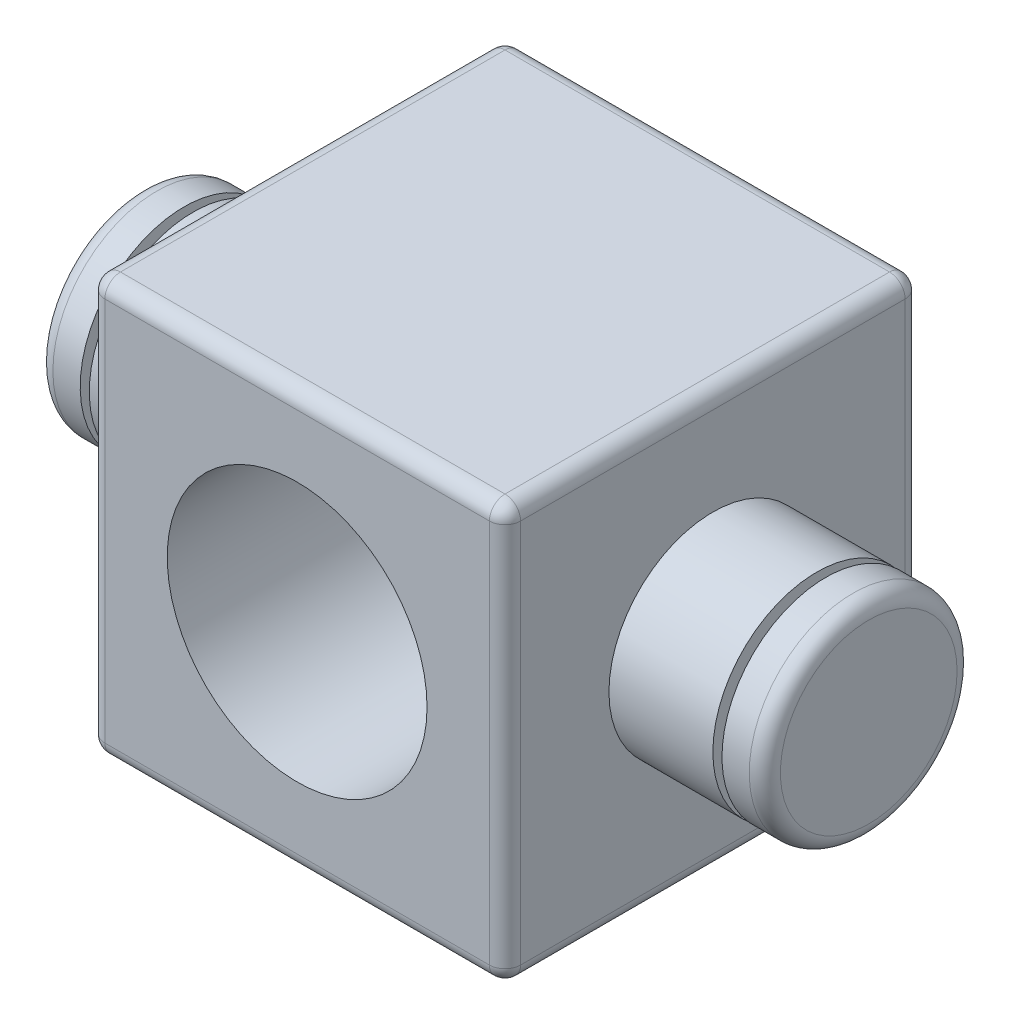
from build123d import *

# Parameters (mm, degrees)
ESQUISSE1_W        = 80
ESQUISSE1_H        = 80
ESQUISSE1_R        = 25
BOSS_EXTRU_1_DEPTH = 80
ESQUISSE2_R        = 20
BOSS_EXTRU_2_DEPTH = 30
BOSS_EXTRU_3_START = 30
ESQUISSE3_R        = 20
BOSS_EXTRU_3_DEPTH = 30
CONG_1_R           = 3
ESQUISSE4_W        = 1.75
ESQUISSE4_H        = 2.5


with BuildPart() as part:
    # Esquisse1 → Boss.-Extru.1 (new body)
    with BuildSketch(Plane.XY):
        with Locations((40, 40)):
            Rectangle(ESQUISSE1_W, ESQUISSE1_H)
        with Locations((40, 40)):
            Circle(ESQUISSE1_R, mode=Mode.SUBTRACT)
    extrude(amount=BOSS_EXTRU_1_DEPTH)

    # Esquisse2 → Boss.-Extru.2 (add)
    with BuildSketch(Plane(origin=(80, 0, 0), x_dir=(0, 0, -1), z_dir=(1, 0, 0))):
        with Locations(Location((-40, 40, 0), (0, 0, 180))):
            Circle(ESQUISSE2_R)
    extrude(amount=BOSS_EXTRU_2_DEPTH)

    # Esquisse3 → Boss.-Extru.3 (add)
    with BuildSketch(Plane.ZY.offset(BOSS_EXTRU_3_START)):
        with Locations((40, 40)):
            Circle(ESQUISSE3_R)
    extrude(amount=-BOSS_EXTRU_3_DEPTH)

    # Cong_1
    cong_1_edges = [part.edges().sort_by_distance(p)[0] for p in [
        (80, 40, 80),
        (40, 80, 80),
        (110, 40, 20),
        (-30, 40, 20),
        (0, 40, 80),
        (40, 80, 0),
        (80, 40, 0),
        (40, 0, 0),
        (0, 40, 0),
        (40, 0, 80),
        (0, 80, 40),
        (80, 80, 40),
        (80, 0, 40),
        (0, 0, 40),
    ]]
    fillet(cong_1_edges, radius=CONG_1_R)

    # Esquisse4 → Enl_vement de mati_re-R_volution1 (revolve, cut)
    with BuildSketch(Plane.XY.offset(40), mode=Mode.PRIVATE) as enl_vement_de_mati_re_r_volution1_sk:
        with Locations((-20.875, 58.75)):
            Rectangle(ESQUISSE4_W, ESQUISSE4_H)
        with Locations((100.875, 58.75)):
            Rectangle(ESQUISSE4_W, ESQUISSE4_H)
    revolve(enl_vement_de_mati_re_r_volution1_sk.sketch.rotate(Axis((-30, 40, 40), (1, 0, 0)), 180), axis=Axis((-30, 40, 40), (1, 0, 0)), mode=Mode.SUBTRACT)


solid = part.part
